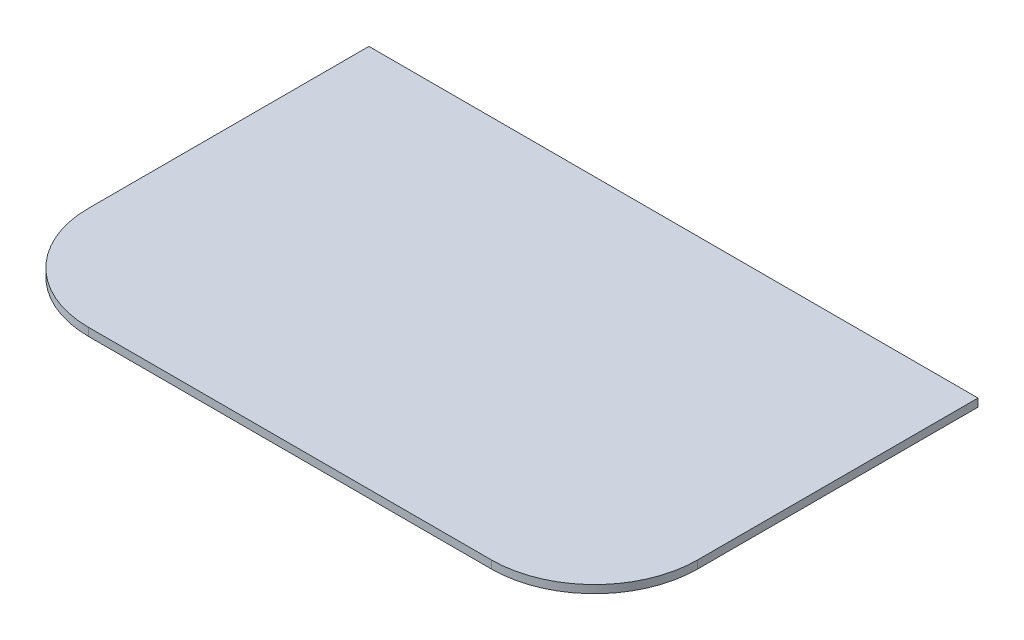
ISO-10303-21;
HEADER;
FILE_DESCRIPTION(('STEP AP214'),'2;1');
FILE_NAME('part.step','',(''),(''),'','','');
FILE_SCHEMA(('AUTOMOTIVE_DESIGN { 1 0 10303 214 1 1 1 1 }'));
ENDSEC;
DATA;
#1=APPLICATION_CONTEXT('core data for automotive mechanical design processes');
#2=APPLICATION_PROTOCOL_DEFINITION('international standard','automotive_design',2000,#1);
#3=PRODUCT_CONTEXT('',#1,'mechanical');
#4=PRODUCT('Part','Part','',(#3));
#5=PRODUCT_RELATED_PRODUCT_CATEGORY('part','',(#4));
#6=PRODUCT_DEFINITION_FORMATION('','',#4);
#7=PRODUCT_DEFINITION_CONTEXT('part definition',#1,'design');
#8=PRODUCT_DEFINITION('design','',#6,#7);
#9=PRODUCT_DEFINITION_SHAPE('','',#8);
#10=(LENGTH_UNIT() NAMED_UNIT(*) SI_UNIT(.MILLI.,.METRE.));
#11=(NAMED_UNIT(*) PLANE_ANGLE_UNIT() SI_UNIT($,.RADIAN.));
#12=(NAMED_UNIT(*) SI_UNIT($,.STERADIAN.) SOLID_ANGLE_UNIT());
#13=UNCERTAINTY_MEASURE_WITH_UNIT(LENGTH_MEASURE(1.E-05),#10,'distance_accuracy_value','');
#14=(GEOMETRIC_REPRESENTATION_CONTEXT(3) GLOBAL_UNCERTAINTY_ASSIGNED_CONTEXT((#13)) GLOBAL_UNIT_ASSIGNED_CONTEXT((#10,
#11,#12)) REPRESENTATION_CONTEXT('',''));
#15=CARTESIAN_POINT('',(0.,0.,0.));
#16=DIRECTION('',(0.,0.,1.));
#17=DIRECTION('',(1.,0.,0.));
#18=AXIS2_PLACEMENT_3D('',#15,#16,#17);
#19=CARTESIAN_POINT('',(-97.583610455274,2.54,-61.4375122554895));
#20=DIRECTION('',(1.,0.,0.));
#21=DIRECTION('',(0.,0.,-1.));
#22=AXIS2_PLACEMENT_3D('',#19,#20,#21);
#23=PLANE('',#22);
#24=DIRECTION('',(0.,0.,1.));
#25=VECTOR('',#24,1.);
#26=CARTESIAN_POINT('',(-97.583610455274,0.,-61.4375122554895));
#27=LINE('',#26,#25);
#28=CARTESIAN_POINT('',(-97.583610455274,0.,-61.4375122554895));
#29=VERTEX_POINT('',#28);
#30=CARTESIAN_POINT('',(-97.583610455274,0.,28.4175122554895));
#31=VERTEX_POINT('',#30);
#32=EDGE_CURVE('E108',#29,#31,#27,.T.);
#33=ORIENTED_EDGE('',*,*,#32,.T.);
#34=DIRECTION('',(0.,-1.,0.));
#35=VECTOR('',#34,1.);
#36=CARTESIAN_POINT('',(-97.583610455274,2.54,28.4175122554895));
#37=LINE('',#36,#35);
#38=CARTESIAN_POINT('',(-97.583610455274,2.54,28.4175122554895));
#39=VERTEX_POINT('',#38);
#40=EDGE_CURVE('E53',#31,#39,#37,.F.);
#41=ORIENTED_EDGE('',*,*,#40,.T.);
#42=DIRECTION('',(0.,0.,1.));
#43=VECTOR('',#42,1.);
#44=CARTESIAN_POINT('',(-97.583610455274,2.54,-61.4375122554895));
#45=LINE('',#44,#43);
#46=CARTESIAN_POINT('',(-97.583610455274,2.54,-61.4375122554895));
#47=VERTEX_POINT('',#46);
#48=EDGE_CURVE('E109',#47,#39,#45,.T.);
#49=ORIENTED_EDGE('',*,*,#48,.F.);
#50=DIRECTION('',(0.,-1.,0.));
#51=VECTOR('',#50,1.);
#52=CARTESIAN_POINT('',(-97.583610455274,2.54,-61.4375122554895));
#53=LINE('',#52,#51);
#54=EDGE_CURVE('E103',#47,#29,#53,.T.);
#55=ORIENTED_EDGE('',*,*,#54,.T.);
#56=EDGE_LOOP('',(#33,#41,#49,#55));
#57=FACE_BOUND('',#56,.T.);
#58=ADVANCED_FACE('F31',(#57),#23,.F.);
#59=CARTESIAN_POINT('',(-97.583610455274,2.54,61.4375122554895));
#60=DIRECTION('',(0.,0.,-1.));
#61=DIRECTION('',(-1.,0.,0.));
#62=AXIS2_PLACEMENT_3D('',#59,#60,#61);
#63=PLANE('',#62);
#64=DIRECTION('',(1.,0.,0.));
#65=VECTOR('',#64,1.);
#66=CARTESIAN_POINT('',(-97.583610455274,2.54,61.4375122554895));
#67=LINE('',#66,#65);
#68=CARTESIAN_POINT('',(-64.563610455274,2.54,61.4375122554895));
#69=VERTEX_POINT('',#68);
#70=CARTESIAN_POINT('',(64.5636104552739,2.54,61.4375122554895));
#71=VERTEX_POINT('',#70);
#72=EDGE_CURVE('E111',#69,#71,#67,.T.);
#73=ORIENTED_EDGE('',*,*,#72,.F.);
#74=DIRECTION('',(0.,-1.,0.));
#75=VECTOR('',#74,1.);
#76=CARTESIAN_POINT('',(-64.563610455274,2.54,61.4375122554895));
#77=LINE('',#76,#75);
#78=CARTESIAN_POINT('',(-64.563610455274,0.,61.4375122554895));
#79=VERTEX_POINT('',#78);
#80=EDGE_CURVE('E121',#69,#79,#77,.T.);
#81=ORIENTED_EDGE('',*,*,#80,.T.);
#82=DIRECTION('',(1.,0.,0.));
#83=VECTOR('',#82,1.);
#84=CARTESIAN_POINT('',(-97.583610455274,0.,61.4375122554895));
#85=LINE('',#84,#83);
#86=CARTESIAN_POINT('',(64.5636104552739,0.,61.4375122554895));
#87=VERTEX_POINT('',#86);
#88=EDGE_CURVE('E95',#79,#87,#85,.T.);
#89=ORIENTED_EDGE('',*,*,#88,.T.);
#90=DIRECTION('',(0.,-1.,0.));
#91=VECTOR('',#90,1.);
#92=CARTESIAN_POINT('',(64.5636104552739,2.54,61.4375122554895));
#93=LINE('',#92,#91);
#94=EDGE_CURVE('E102',#87,#71,#93,.F.);
#95=ORIENTED_EDGE('',*,*,#94,.T.);
#96=EDGE_LOOP('',(#73,#81,#89,#95));
#97=FACE_BOUND('',#96,.T.);
#98=ADVANCED_FACE('F135',(#97),#63,.F.);
#99=CARTESIAN_POINT('',(97.583610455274,2.54,-61.4375122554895));
#100=DIRECTION('',(-1.,0.,0.));
#101=DIRECTION('',(0.,0.,1.));
#102=AXIS2_PLACEMENT_3D('',#99,#100,#101);
#103=PLANE('',#102);
#104=DIRECTION('',(0.,0.,-1.));
#105=VECTOR('',#104,1.);
#106=CARTESIAN_POINT('',(97.583610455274,2.54,-61.4375122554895));
#107=LINE('',#106,#105);
#108=CARTESIAN_POINT('',(97.583610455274,2.54,28.4175122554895));
#109=VERTEX_POINT('',#108);
#110=CARTESIAN_POINT('',(97.583610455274,2.54,-61.4375122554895));
#111=VERTEX_POINT('',#110);
#112=EDGE_CURVE('E116',#109,#111,#107,.T.);
#113=ORIENTED_EDGE('',*,*,#112,.F.);
#114=DIRECTION('',(0.,-1.,0.));
#115=VECTOR('',#114,1.);
#116=CARTESIAN_POINT('',(97.583610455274,2.54,28.4175122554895));
#117=LINE('',#116,#115);
#118=CARTESIAN_POINT('',(97.583610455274,0.,28.4175122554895));
#119=VERTEX_POINT('',#118);
#120=EDGE_CURVE('E11',#109,#119,#117,.T.);
#121=ORIENTED_EDGE('',*,*,#120,.T.);
#122=DIRECTION('',(0.,0.,-1.));
#123=VECTOR('',#122,1.);
#124=CARTESIAN_POINT('',(97.583610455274,0.,-61.4375122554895));
#125=LINE('',#124,#123);
#126=CARTESIAN_POINT('',(97.583610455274,0.,-61.4375122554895));
#127=VERTEX_POINT('',#126);
#128=EDGE_CURVE('E86',#119,#127,#125,.T.);
#129=ORIENTED_EDGE('',*,*,#128,.T.);
#130=DIRECTION('',(0.,-1.,0.));
#131=VECTOR('',#130,1.);
#132=CARTESIAN_POINT('',(97.583610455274,2.54,-61.4375122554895));
#133=LINE('',#132,#131);
#134=EDGE_CURVE('E89',#111,#127,#133,.T.);
#135=ORIENTED_EDGE('',*,*,#134,.F.);
#136=EDGE_LOOP('',(#113,#121,#129,#135));
#137=FACE_BOUND('',#136,.T.);
#138=ADVANCED_FACE('F88',(#137),#103,.F.);
#139=CARTESIAN_POINT('',(-97.583610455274,2.54,-61.4375122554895));
#140=DIRECTION('',(0.,0.,1.));
#141=DIRECTION('',(1.,0.,0.));
#142=AXIS2_PLACEMENT_3D('',#139,#140,#141);
#143=PLANE('',#142);
#144=DIRECTION('',(-1.,0.,0.));
#145=VECTOR('',#144,1.);
#146=CARTESIAN_POINT('',(-97.583610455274,0.,-61.4375122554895));
#147=LINE('',#146,#145);
#148=EDGE_CURVE('E94',#127,#29,#147,.T.);
#149=ORIENTED_EDGE('',*,*,#148,.T.);
#150=ORIENTED_EDGE('',*,*,#54,.F.);
#151=DIRECTION('',(-1.,0.,0.));
#152=VECTOR('',#151,1.);
#153=CARTESIAN_POINT('',(-97.583610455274,2.54,-61.4375122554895));
#154=LINE('',#153,#152);
#155=EDGE_CURVE('E101',#111,#47,#154,.T.);
#156=ORIENTED_EDGE('',*,*,#155,.F.);
#157=ORIENTED_EDGE('',*,*,#134,.T.);
#158=EDGE_LOOP('',(#149,#150,#156,#157));
#159=FACE_BOUND('',#158,.T.);
#160=ADVANCED_FACE('F98',(#159),#143,.F.);
#161=CARTESIAN_POINT('',(-97.583610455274,2.54,-61.4375122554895));
#162=DIRECTION('',(0.,1.,0.));
#163=DIRECTION('',(0.,0.,1.));
#164=AXIS2_PLACEMENT_3D('',#161,#162,#163);
#165=PLANE('',#164);
#166=ORIENTED_EDGE('',*,*,#48,.T.);
#167=CARTESIAN_POINT('',(-64.563610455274,2.54,28.4175122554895));
#168=DIRECTION('',(0.,1.,0.));
#169=DIRECTION('',(0.,0.,1.));
#170=AXIS2_PLACEMENT_3D('',#167,#168,#169);
#171=CIRCLE('',#170,33.02);
#172=EDGE_CURVE('E38',#39,#69,#171,.T.);
#173=ORIENTED_EDGE('',*,*,#172,.T.);
#174=ORIENTED_EDGE('',*,*,#72,.T.);
#175=CARTESIAN_POINT('',(64.5636104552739,2.54,28.4175122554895));
#176=DIRECTION('',(0.,1.,0.));
#177=DIRECTION('',(0.,0.,1.));
#178=AXIS2_PLACEMENT_3D('',#175,#176,#177);
#179=CIRCLE('',#178,33.02);
#180=EDGE_CURVE('E45',#71,#109,#179,.T.);
#181=ORIENTED_EDGE('',*,*,#180,.T.);
#182=ORIENTED_EDGE('',*,*,#112,.T.);
#183=ORIENTED_EDGE('',*,*,#155,.T.);
#184=EDGE_LOOP('',(#166,#173,#174,#181,#182,#183));
#185=FACE_BOUND('',#184,.T.);
#186=ADVANCED_FACE('F131',(#185),#165,.T.);
#187=CARTESIAN_POINT('',(-97.583610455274,0.,-61.4375122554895));
#188=DIRECTION('',(0.,1.,0.));
#189=DIRECTION('',(0.,0.,1.));
#190=AXIS2_PLACEMENT_3D('',#187,#188,#189);
#191=PLANE('',#190);
#192=ORIENTED_EDGE('',*,*,#88,.F.);
#193=CARTESIAN_POINT('',(-64.563610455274,0.,28.4175122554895));
#194=DIRECTION('',(0.,1.,0.));
#195=DIRECTION('',(0.,0.,1.));
#196=AXIS2_PLACEMENT_3D('',#193,#194,#195);
#197=CIRCLE('',#196,33.02);
#198=EDGE_CURVE('E126',#79,#31,#197,.F.);
#199=ORIENTED_EDGE('',*,*,#198,.T.);
#200=ORIENTED_EDGE('',*,*,#32,.F.);
#201=ORIENTED_EDGE('',*,*,#148,.F.);
#202=ORIENTED_EDGE('',*,*,#128,.F.);
#203=CARTESIAN_POINT('',(64.5636104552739,0.,28.4175122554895));
#204=DIRECTION('',(0.,1.,0.));
#205=DIRECTION('',(0.,0.,1.));
#206=AXIS2_PLACEMENT_3D('',#203,#204,#205);
#207=CIRCLE('',#206,33.02);
#208=EDGE_CURVE('E124',#119,#87,#207,.F.);
#209=ORIENTED_EDGE('',*,*,#208,.T.);
#210=EDGE_LOOP('',(#192,#199,#200,#201,#202,#209));
#211=FACE_BOUND('',#210,.T.);
#212=ADVANCED_FACE('F107',(#211),#191,.F.);
#213=CARTESIAN_POINT('',(-64.563610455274,2.54,28.4175122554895));
#214=DIRECTION('',(0.,-1.,0.));
#215=DIRECTION('',(0.,0.,-1.));
#216=AXIS2_PLACEMENT_3D('',#213,#214,#215);
#217=CYLINDRICAL_SURFACE('',#216,33.02);
#218=ORIENTED_EDGE('',*,*,#172,.F.);
#219=ORIENTED_EDGE('',*,*,#40,.F.);
#220=ORIENTED_EDGE('',*,*,#198,.F.);
#221=ORIENTED_EDGE('',*,*,#80,.F.);
#222=EDGE_LOOP('',(#218,#219,#220,#221));
#223=FACE_BOUND('',#222,.T.);
#224=ADVANCED_FACE('F138',(#223),#217,.T.);
#225=CARTESIAN_POINT('',(64.5636104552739,2.54,28.4175122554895));
#226=DIRECTION('',(0.,-1.,0.));
#227=DIRECTION('',(0.,0.,-1.));
#228=AXIS2_PLACEMENT_3D('',#225,#226,#227);
#229=CYLINDRICAL_SURFACE('',#228,33.02);
#230=ORIENTED_EDGE('',*,*,#180,.F.);
#231=ORIENTED_EDGE('',*,*,#94,.F.);
#232=ORIENTED_EDGE('',*,*,#208,.F.);
#233=ORIENTED_EDGE('',*,*,#120,.F.);
#234=EDGE_LOOP('',(#230,#231,#232,#233));
#235=FACE_BOUND('',#234,.T.);
#236=ADVANCED_FACE('F141',(#235),#229,.T.);
#237=CLOSED_SHELL('',(#58,#98,#138,#160,#186,#212,#224,#236));
#238=MANIFOLD_SOLID_BREP('B2',#237);
#239=ADVANCED_BREP_SHAPE_REPRESENTATION('',(#18,#238),#14);
#240=SHAPE_DEFINITION_REPRESENTATION(#9,#239);
ENDSEC;
END-ISO-10303-21;
